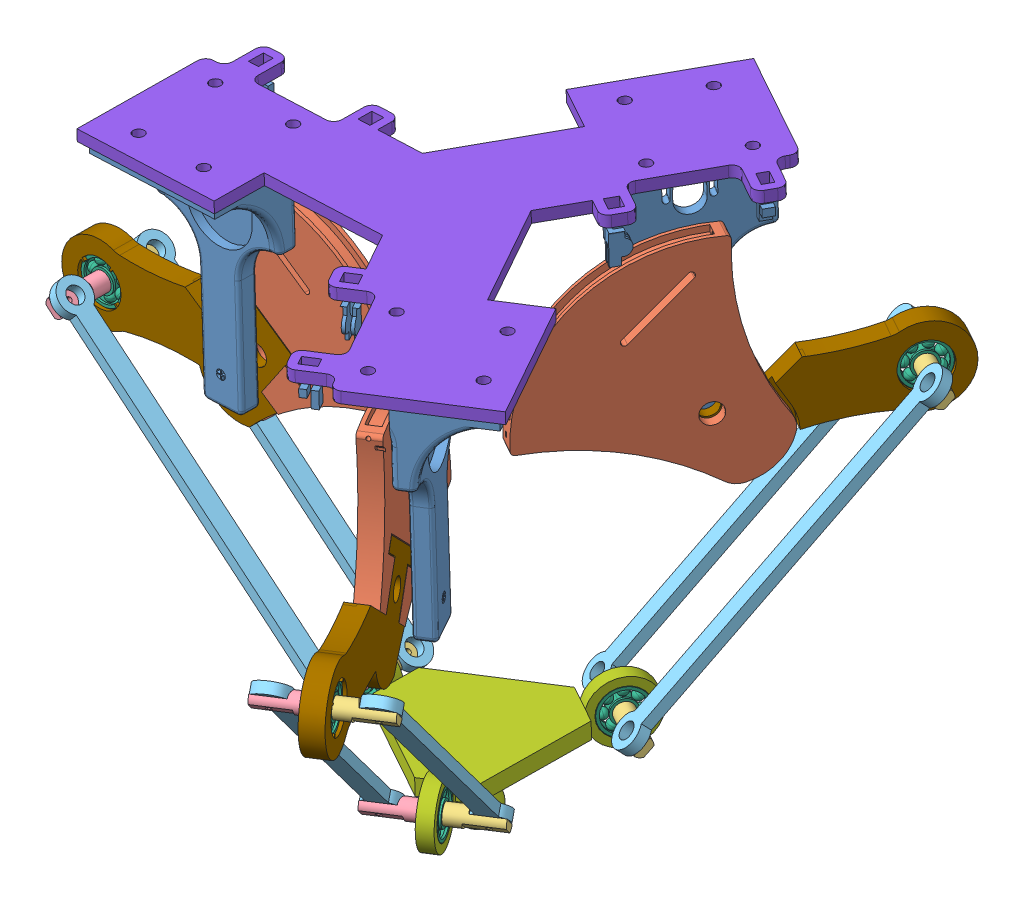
SolidWorks assembly 3D-Hapkit.SLDASM, configuration Default (file format 15000). Lengths in mm.
Overall size (316.55 274.88 353.95).
41 component instances, 9 part files, 75 mates.
Components (placement in the parent):
- Hapkit3_0_Base-3: Hapkit3_0_Base.SLDPRT [Default] at (129.5334 197.045 107.4607) x (0.500163 0.01316 -0.865831) z (-0.864834 -0.042739 -0.500236) size (72.8 114.98 77.62)
- Hapkit Sector Pulley-3: Hapkit Sector Pulley.SLDPRT [Default] at (135.7794 96.3952 109.3196) x (0.335527 0.691988 -0.639198) z (-0.864834 -0.042739 -0.500236) size (113.37 109.9 10.02)
- Hapkit3_0_Base-4: Hapkit3_0_Base.SLDPRT [Default] at (-15.1438 191.5074 184.9091) x (-0.999049 -0.043593 -0.000301) z (-0.000737 0.009973 0.99995) size (72.8 114.98 77.62)
- Hapkit Sector Pulley-4: Hapkit Sector Pulley.SLDPRT [Default] at (-10.9367 90.7398 183.8871) x (-0.828191 0.560411 -0.006199) z (-0.000737 0.009973 0.99995) size (113.37 109.9 10.02)
- Hapkit3_0_Base-5: Hapkit3_0_Base.SLDPRT [Default] at (124.152 198.4521 271.5627) x (0.498887 0.030433 0.866133) z (0.865571 0.032767 -0.499714) size (72.8 114.98 77.62)
- Hapkit Sector Pulley-5: Hapkit Sector Pulley.SLDPRT [Default] at (126.8851 97.6523 273.7496) x (0.353583 0.666654 0.656165) z (0.865571 0.032767 -0.499714) size (113.37 109.9 10.02)
- Copy of Copy of Assem18^3D-Hapkit-1: Copy of Copy of Assem18^3D-Hapkit.SLDASM [Default] at (314.4506 344.5997 544.5784) x (0.615917 -0.378367 -0.691003) z (-0.664342 -0.720883 -0.197425) size (52.68 10.1 36.25) (virtual)
  - Connector_Male-1: Connector_Male.SLDPRT [Default] at (147.9383 -61.4761 309.4484) x (0.495711 -0.130698 0.858597) z (0.065349 0.991422 0.113188) size (9 31 9)
  - Connector_Female-1: Connector_Female.SLDPRT [Default] at (141.8761 -61.4761 312.9484) x (-0.495711 0.130698 -0.858597) z (0.065349 0.991422 0.113188) size (9 31 9)
- Linkage-5: Linkage.SLDPRT [Default] at (161.8939 43.234 274.3194) x (0.291399 0.729119 0.619251) z (0.87577 0.057101 -0.47934) size (185.62 5 15.62)
- Linkage-6: Linkage.SLDPRT [Default] at (126.5759 41.897 294.7093) x (0.291399 0.729119 0.619251) z (0.87577 0.057101 -0.47934) size (185.62 5 15.62)
- Copy of Copy of Assem18^3D-Hapkit-2: Copy of Copy of Assem18^3D-Hapkit.SLDASM [Default] at (264.9128 220.6494 439.3057) x (0.615917 -0.378367 -0.691003) z (-0.664342 -0.720883 -0.197425) size (52.68 10.1 36.25) (virtual)
  - Connector_Male-1: Connector_Male.SLDPRT [Default] at (147.9383 -61.4761 309.4484) x (0.495711 -0.130698 0.858597) z (0.065349 0.991422 0.113188) size (9 31 9)
  - Connector_Female-1: Connector_Female.SLDPRT [Default] at (141.8761 -61.4761 312.9484) x (-0.495711 0.130698 -0.858597) z (0.065349 0.991422 0.113188) size (9 31 9)
- 608-2RS.step-1: 608-2RS.step.SLDPRT [Default] at (170.9281 101.1307 340.2602) x (-0.492662 -0.123309 -0.86144) z (-0.865571 -0.032767 0.499714) size (22 22 7)
- 608-2RS.step-2: 608-2RS.step.SLDPRT [Default] at (171.0133 102.2705 37.9082) x (-0.207141 -0.877238 0.433065) z (0.864834 0.042739 0.500236) size (22 22 7)
- 608-2RS.step-3: 608-2RS.step.SLDPRT [Default] at (-89.8674 83.0579 188.9058) x (-0.992355 -0.123414 0.0005) z (-0.000737 0.009973 0.99995) size (22 22 7)
- Copy (2) of Copy of Assem18^3D-Hapkit-1: Copy (2) of Copy of Assem18^3D-Hapkit.SLDASM [Default] at (156.7935 -142.3859 165.0484) x (-0.419801 0.261959 -0.868991) z (-0.72859 0.473672 0.494764) size (52.68 10.1 36.25) (virtual)
  - Connector_Male-1: Connector_Male.SLDPRT [Default] at (144.9048 -55.8729 296.5548) x (0.495711 -0.130698 0.858597) z (0.065349 0.991422 0.113188) size (9 31 9)
  - Connector_Female-1: Connector_Female.SLDPRT [Default] at (138.8426 -55.8729 300.0548) x (-0.495711 0.130698 -0.858597) z (0.065349 0.991422 0.113188) size (9 31 9)
- Linkage-7: Linkage.SLDPRT [Default] at (-21.7761 31.7146 167.9196) x (-0.762869 0.646521 0.00647) z (0.009547 0.001258 0.999954) size (185.62 5 15.62)
- Linkage-8: Linkage.SLDPRT [Default] at (-21.8062 32.1215 208.7207) x (-0.762869 0.646521 0.00647) z (0.009547 0.001258 0.999954) size (185.62 5 15.62)
- Copy (2) of Copy of Assem18^3D-Hapkit-2: Copy (2) of Copy of Assem18^3D-Hapkit.SLDASM [Default] at (286.4812 -252.2945 163.9485) x (-0.419801 0.261959 -0.868991) z (-0.72859 0.473672 0.494764) size (52.68 10.1 36.25) (virtual)
  - Connector_Male-1: Connector_Male.SLDPRT [Default] at (144.9048 -55.8729 296.5548) x (0.495711 -0.130698 0.858597) z (0.065349 0.991422 0.113188) size (9 31 9)
  - Connector_Female-1: Connector_Female.SLDPRT [Default] at (138.8426 -55.8729 300.0548) x (-0.495711 0.130698 -0.858597) z (0.065349 0.991422 0.113188) size (9 31 9)
- Copy (3) of Copy of Assem18^3D-Hapkit-1: Copy (3) of Copy of Assem18^3D-Hapkit.SLDASM [Default] at (104.658 -152.7454 226.9623) x (0.927399 0.36127 0.097032) z (-0.123365 0.540259 -0.832407) size (52.68 10.1 36.25) (virtual)
  - Connector_Male-1: Connector_Male.SLDPRT [Default] at (138.354 -67.231 285.2086) x (0.495711 -0.130698 0.858597) z (0.065349 0.991422 0.113188) size (9 31 9)
  - Connector_Female-1: Connector_Female.SLDPRT [Default] at (132.2918 -67.231 288.7086) x (-0.495711 0.130698 -0.858597) z (0.065349 0.991422 0.113188) size (9 31 9)
- Linkage-9: Linkage.SLDPRT [Default] at (161.8967 43.4707 102.6405) x (0.291492 0.741357 -0.604502) z (-0.870411 -0.056551 -0.489067) size (185.62 5 15.62)
- Linkage-10: Linkage.SLDPRT [Default] at (126.6088 41.7268 82.2293) x (0.291492 0.741357 -0.604502) z (-0.870411 -0.056551 -0.489067) size (185.62 5 15.62)
- Copy (3) of Copy of Assem18^3D-Hapkit-2: Copy (3) of Copy of Assem18^3D-Hapkit.SLDASM [Default] at (55.1045 -278.776 329.7276) x (0.927399 0.36127 0.097032) z (-0.123365 0.540259 -0.832407) size (52.68 10.1 36.25) (virtual)
  - Connector_Male-1: Connector_Male.SLDPRT [Default] at (138.354 -67.231 285.2086) x (0.495711 -0.130698 0.858597) z (0.065349 0.991422 0.113188) size (9 31 9)
  - Connector_Female-1: Connector_Female.SLDPRT [Default] at (132.2918 -67.231 288.7086) x (-0.495711 0.130698 -0.858597) z (0.065349 0.991422 0.113188) size (9 31 9)
- handle-1: handle.SLDPRT [Default] at (94.3981 -28.4797 187.8624) x (0.864834 0.042739 0.500236) z (-0.500163 -0.01316 0.865831) size (123.8 55.01 107.21)
- 608-2RS.step-4: 608-2RS.step.SLDPRT [Default] at (121.4597 -23.7602 140.6735) x (0.446619 0.389636 -0.805428) z (-0.864834 -0.042739 -0.500236) size (22 22 7)
- 608-2RS.step-5: 608-2RS.step.SLDPRT [Default] at (121.3903 -22.8196 234.9875) x (-0.471719 0.388368 -0.791613) z (-0.865571 -0.032767 0.499714) size (22 22 7)
- 608-2RS.step-6: 608-2RS.step.SLDPRT [Default] at (39.8203 -26.8507 187.8059) x (-0.92221 0.386664 -0.004536) z (-0.000737 0.009973 0.99995) size (22 22 7)
- base-1: base.SLDPRT [Default] at (-41.2235 187.463 194.5535) x (0.999049 0.043593 0.000301) z (-0.000737 0.009973 0.99995) size (243.71 5.5 256.75)
- Actuating Arm-1: Actuating Arm.SLDPRT [Default] at (135.5699 97.1343 109.6186) x (0.335527 0.691988 -0.639198) z (-0.864834 -0.042739 -0.500236) size (101.08 87.42 10)
- Actuating Arm-2: Actuating Arm.SLDPRT [Default] at (-10.2895 91.2502 183.8825) x (-0.828191 0.560411 -0.006199) z (-0.000737 0.009973 0.99995) size (101.08 87.42 10)
- Actuating Arm-3: Actuating Arm.SLDPRT [Default] at (126.6949 98.4039 273.4695) x (0.353583 0.666654 0.656165) z (0.865571 0.032767 -0.499714) size (101.08 87.42 10)
Mates (geometry in assembly coordinates):
- Concentric28: concentric anti-aligned: cylinder of handle-1 through (107.6224 -24.444 132.6698) axis (0.864834 0.042739 0.500236) radius 11; cylinder of 608-2RS.step-4 through (121.4597 -23.7602 140.6735) axis (-0.864834 -0.042739 -0.500236) radius 4
- Coincident58: coincident aligned: plane of handle-1 through (118.4328 -23.9098 138.9227) normal (-0.864834 -0.042739 -0.500236); plane of 608-2RS.step-4 through (120.9555 -34.0295 135.426) normal (-0.864834 -0.042739 -0.500236)
- Concentric29: concentric aligned: cylinder of handle-1 through (135.2394 -22.2953 226.9921) axis (-0.865571 -0.032767 0.499714) radius 11; cylinder of 608-2RS.step-5 through (121.3903 -22.8196 234.9875) axis (-0.865571 -0.032767 0.499714) radius 4
- Coincident59: coincident aligned: plane of handle-1 through (118.3608 -22.9343 236.7365) normal (-0.865571 -0.032767 0.499714); plane of 608-2RS.step-5 through (116.5113 -33.0644 232.8687) normal (-0.865571 -0.032767 0.499714)
- Concentric30: concentric anti-aligned: cylinder of handle-1 through (39.8085 -26.6911 203.8051) axis (0.000737 -0.009973 -0.99995) radius 11; cylinder of 608-2RS.step-6 through (39.8203 -26.8507 187.8059) axis (-0.000737 0.009973 0.99995) radius 11
- Coincident60: coincident aligned: plane of handle-1 through (39.8228 -26.8856 184.3061) normal (0.000737 -0.009973 -0.99995); plane of 608-2RS.step-6 through (36.2266 -35.4618 184.389) normal (0.000737 -0.009973 -0.99995)
- Concentric5: concentric anti-aligned: cylinder of Hapkit3_0_Base-3 through (115.8191 95.4088 97.7742) axis (0.864834 0.042739 0.500236) radius 7.5; cylinder of Hapkit Sector Pulley-3 through (135.7794 96.3952 109.3196) axis (-0.864834 -0.042739 -0.500236) radius 5
- Distance4: distance = 8 mm anti-aligned: plane of Hapkit3_0_Base-3 through (104.8535 81.0797 128.1113) normal (0.864834 0.042739 0.500236); plane of Hapkit3_0_Sector-3 through (171.4675 107.9939 26.6387) normal (-0.864834 -0.042739 -0.500236)
- Concentric2: concentric anti-aligned: cylinder of Hapkit Sector Pulley-3 through (135.7794 96.3952 109.3196) axis (-0.864834 -0.042739 -0.500236) radius 5; cylinder of Hapkit3_0_Base-3 through (115.8191 95.4088 97.7742) axis (0.864834 0.042739 0.500236) radius 7.5
- Concentric34: concentric anti-aligned: cylinder of Hapkit3_0_Base-4 through (-10.9538 90.9699 206.9659) axis (0.000737 -0.009973 -0.99995) radius 7.5; cylinder of Hapkit Sector Pulley-4 through (-10.9367 90.7398 183.8871) axis (-0.000737 0.009973 0.99995) radius 5
- Distance9: distance = 8 mm anti-aligned: plane of Hapkit3_0_Base-4 through (21.576 78.1858 202.0371) normal (0.000737 -0.009973 -0.99995); plane of Hapkit3_0_Sector-4 through (-101.13 87.5536 193.8529) normal (-0.000737 0.009973 0.99995)
- Concentric35: concentric anti-aligned: cylinder of Hapkit Sector Pulley-4 through (-10.9367 90.7398 183.8871) axis (-0.000737 0.009973 0.99995) radius 5; cylinder of Hapkit3_0_Base-4 through (-10.9538 90.9699 206.9659) axis (0.000737 -0.009973 -0.99995) radius 7.5
- Concentric37: concentric anti-aligned: cylinder of Hapkit3_0_Base-5 through (146.8625 98.4085 262.2162) axis (-0.865571 -0.032767 0.499714) radius 7.5; cylinder of Hapkit Sector Pulley-5 through (126.8851 97.6523 273.7496) axis (0.865571 0.032767 -0.499714) radius 5
- Distance11: distance = 8 mm anti-aligned: plane of Hapkit3_0_Base-5 through (127.1473 83.1442 237.2318) normal (-0.865571 -0.032767 0.499714); plane of Hapkit3_0_Sector-5 through (180.1891 106.8819 346.6729) normal (0.865571 0.032767 -0.499714)
- Concentric20: concentric aligned: cylinder of Copy of Copy of Assem18^3D-Hapkit-1/Connector_Male-1 through (190.3189 98.7302 332.8638) axis (-0.384856 0.682 -0.621902) radius 1.35; cylinder of Linkage-5 through (188.587 101.7992 330.0652) axis (-0.384856 0.682 -0.621902) radius 3.9
- Coincident50: coincident anti-aligned: plane of Copy of Copy of Assem18^3D-Hapkit-1/Connector_Male-1 through (189.2486 105.0574 333.229) normal (-0.384856 0.682 -0.621902); plane of Linkage-5 through (188.587 101.7992 330.0652) normal (0.384856 -0.682 0.621902)
- Concentric22: concentric aligned: cylinder of Copy of Copy of Assem18^3D-Hapkit-1/Connector_Female-1 through (155.0009 97.3932 353.2537) axis (-0.384856 0.682 -0.621902) radius 1.35; cylinder of Linkage-6 through (153.2691 100.4622 350.4551) axis (-0.384856 0.682 -0.621902) radius 3.9
- Coincident52: coincident anti-aligned: plane of Copy of Copy of Assem18^3D-Hapkit-1/Connector_Female-1 through (152.6075 97.2039 347.2914) normal (-0.384856 0.682 -0.621902); plane of Linkage-6 through (153.2691 100.4622 350.4551) normal (0.384856 -0.682 0.621902)
- Coincident54: coincident anti-aligned: plane of Linkage-5 through (188.587 101.7992 330.0652) normal (0.384856 -0.682 0.621902); plane of Copy of Copy of Assem18^3D-Hapkit-2/Connector_Male-1 through (139.7108 -18.8929 227.9563) normal (-0.384856 0.682 -0.621902)
- Concentric24: concentric anti-aligned: circle of Green Linkage-5; circle of Copy of Copy of Assem18^3D-Hapkit-2/Pink Linkage_Famale-1
- Coincident53: coincident anti-aligned: plane of Linkage-6 through (153.2691 100.4622 350.4551) normal (0.384856 -0.682 0.621902); plane of Copy of Copy of Assem18^3D-Hapkit-2/Connector_Female-1 through (103.0697 -26.7463 242.0188) normal (-0.384856 0.682 -0.621902)
- Concentric23: concentric aligned: cylinder of Linkage-6 through (103.7313 -23.4881 245.1825) axis (-0.384856 0.682 -0.621902) radius 3.9; cylinder of Copy of Copy of Assem18^3D-Hapkit-2/Connector_Female-1 through (105.4631 -26.5571 247.981) axis (-0.384856 0.682 -0.621902) radius 1.35
- Concentric41: concentric anti-aligned: cylinder of Copy of Copy of Assem18^3D-Hapkit-1/Connector_Female-1 through (167.8986 101.016 342.0092) axis (0.865571 0.032767 -0.499714) radius 3.95; cylinder of 608-2RS.step-1 through (170.9281 101.1307 340.2602) axis (-0.865571 -0.032767 0.499714) radius 4
- Coincident75: coincident anti-aligned: plane of Copy of Copy of Assem18^3D-Hapkit-1/Connector_Female-1 through (167.8986 101.016 342.0092) normal (0.865571 0.032767 -0.499714); plane of 608-2RS.step-1 through (168.4107 95.3626 342.5256) normal (-0.865571 -0.032767 0.499714)
- Concentric42: concentric anti-aligned: cylinder of Copy of Copy of Assem18^3D-Hapkit-2/Connector_Female-1 through (118.3608 -22.9343 236.7365) axis (0.865571 0.032767 -0.499714) radius 3.95; cylinder of 608-2RS.step-5 through (121.3903 -22.8196 234.9875) axis (-0.865571 -0.032767 0.499714) radius 4
- Coincident76: coincident anti-aligned: plane of Copy of Copy of Assem18^3D-Hapkit-2/Connector_Male-1 through (124.4197 -22.7049 233.2385) normal (-0.865571 -0.032767 0.499714); plane of 608-2RS.step-5 through (123.7472 -26.3886 231.832) normal (0.865571 0.032767 -0.499714)
- Concentric43: concentric aligned: cylinder of Copy (2) of Copy of Assem18^3D-Hapkit-1/Connector_Male-1 through (-92.7616 79.4214 168.5373) axis (0.646483 0.762895 -0.007132) radius 1.35; cylinder of Linkage-7 through (-89.8524 82.8544 168.5052) axis (0.646483 0.762895 -0.007132) radius 3.9
- Coincident77: coincident anti-aligned: plane of Copy (2) of Copy of Assem18^3D-Hapkit-1/Connector_Male-1 through (-86.4199 79.9544 169.4383) normal (0.646483 0.762895 -0.007132); plane of Linkage-7 through (-89.8524 82.8544 168.5052) normal (-0.646483 -0.762895 0.007132)
- Concentric44: concentric aligned: cylinder of Copy (2) of Copy of Assem18^3D-Hapkit-1/Connector_Female-1 through (-92.7916 79.8283 209.3384) axis (0.646483 0.762895 -0.007132) radius 1.35; cylinder of Linkage-8 through (-89.8824 83.2613 209.3063) axis (0.646483 0.762895 -0.007132) radius 3.9
- Coincident78: coincident anti-aligned: plane of Copy (2) of Copy of Assem18^3D-Hapkit-1/Connector_Female-1 through (-93.315 86.1613 208.3733) normal (0.646483 0.762895 -0.007132); plane of Linkage-8 through (-89.8824 83.2613 209.3063) normal (-0.646483 -0.762895 0.007132)
- Coincident79: coincident anti-aligned: plane of Linkage-7 through (-89.8524 82.8544 168.5052) normal (-0.646483 -0.762895 0.007132); plane of Copy (2) of Copy of Assem18^3D-Hapkit-2/Connector_Male-1 through (43.2678 -29.9542 168.3384) normal (0.646483 0.762895 -0.007132)
- Concentric45: concentric anti-aligned: circle of Green Linkage-7; circle of Copy (2) of Copy of Assem18^3D-Hapkit-2/Pink Linkage_Famale-1
- Coincident80: coincident anti-aligned: plane of Linkage-8 through (-89.8824 83.2613 209.3063) normal (-0.646483 -0.762895 0.007132); plane of Copy (2) of Copy of Assem18^3D-Hapkit-2/Connector_Female-1 through (36.3727 -23.7472 207.2734) normal (0.646483 0.762895 -0.007132)
- Concentric46: concentric aligned: cylinder of Linkage-8 through (39.8052 -26.6472 208.2064) axis (0.646483 0.762895 -0.007132) radius 3.9; cylinder of Copy (2) of Copy of Assem18^3D-Hapkit-2/Connector_Female-1 through (36.8961 -30.0803 208.2385) axis (0.646483 0.762895 -0.007132) radius 1.35
- Concentric47: concentric anti-aligned: cylinder of 608-2RS.step-3 through (-89.8674 83.0579 188.9058) axis (-0.000737 0.009973 0.99995) radius 4; cylinder of Copy (2) of Copy of Assem18^3D-Hapkit-1/Connector_Female-1 through (-89.87 83.0928 192.4056) axis (0.000737 -0.009973 -0.99995) radius 3.95
- Coincident81: coincident anti-aligned: plane of 608-2RS.step-3 through (-89.3712 79.0537 185.4459) normal (0.000737 -0.009973 -0.99995); plane of Copy (2) of Copy of Assem18^3D-Hapkit-1/Connector_Male-1 through (-89.8648 83.023 185.406) normal (-0.000737 0.009973 0.99995)
- Concentric48: concentric anti-aligned: cylinder of Copy (2) of Copy of Assem18^3D-Hapkit-2/Connector_Female-1 through (39.8177 -26.8158 191.3057) axis (0.000737 -0.009973 -0.99995) radius 3.95; cylinder of 608-2RS.step-6 through (39.8203 -26.8507 187.8059) axis (-0.000737 0.009973 0.99995) radius 4
- Concentric49: concentric aligned: cylinder of Copy (3) of Copy of Assem18^3D-Hapkit-1/Connector_Male-1 through (190.4427 100.1332 45.2842) axis (-0.396758 0.668724 0.628801) radius 1.35; cylinder of Linkage-9 through (188.6573 103.1424 48.1138) axis (-0.396758 0.668724 0.628801) radius 3.9
- Coincident82: coincident anti-aligned: plane of Copy (3) of Copy of Assem18^3D-Hapkit-1/Connector_Male-1 through (186.4932 99.7636 50.3416) normal (-0.396758 0.668724 0.628801); plane of Linkage-9 through (188.6573 103.1424 48.1138) normal (0.396758 -0.668724 -0.628801)
- Concentric50: concentric aligned: cylinder of Copy (3) of Copy of Assem18^3D-Hapkit-1/Connector_Female-1 through (155.1548 98.3893 24.873) axis (-0.396758 0.668724 0.628801) radius 1.35; cylinder of Linkage-10 through (153.3694 101.3985 27.7026) axis (-0.396758 0.668724 0.628801) radius 3.9
- Coincident83: coincident anti-aligned: plane of Copy (3) of Copy of Assem18^3D-Hapkit-1/Connector_Female-1 through (155.5335 104.7773 25.4748) normal (-0.396758 0.668724 0.628801); plane of Linkage-10 through (153.3694 101.3985 27.7026) normal (0.396758 -0.668724 -0.628801)
- Coincident84: coincident anti-aligned: plane of Linkage-9 through (188.6573 103.1424 48.1138) normal (0.396758 -0.668724 -0.628801); plane of Copy (3) of Copy of Assem18^3D-Hapkit-2/Connector_Male-1 through (136.9396 -26.2671 153.1069) normal (-0.396758 0.668724 0.628801)
- Concentric51: concentric anti-aligned: circle of Green Linkage-9; circle of Copy (3) of Copy of Assem18^3D-Hapkit-2/Pink Linkage_Famale-1
- Coincident85: coincident anti-aligned: plane of Linkage-10 through (153.3694 101.3985 27.7026) normal (0.396758 -0.668724 -0.628801); plane of Copy (3) of Copy of Assem18^3D-Hapkit-2/Connector_Female-1 through (105.9799 -21.2534 128.2401) normal (-0.396758 0.668724 0.628801)
- Concentric52: concentric aligned: cylinder of Linkage-10 through (103.8158 -24.6322 130.4679) axis (-0.396758 0.668724 0.628801) radius 3.9; cylinder of Copy (3) of Copy of Assem18^3D-Hapkit-2/Connector_Female-1 through (105.6012 -27.6414 127.6383) axis (-0.396758 0.668724 0.628801) radius 1.35
- Concentric53: concentric aligned: cylinder of 608-2RS.step-2 through (171.0133 102.2705 37.9082) axis (0.864834 0.042739 0.500236) radius 4; cylinder of Copy (3) of Copy of Assem18^3D-Hapkit-1/Connector_Female-1 through (167.9864 102.1209 36.1574) axis (0.864834 0.042739 0.500236) radius 3.95
- Coincident86: coincident anti-aligned: plane of 608-2RS.step-2 through (176.647 99.6946 35.3851) normal (0.864834 0.042739 0.500236); plane of Copy (3) of Copy of Assem18^3D-Hapkit-1/Connector_Male-1 through (174.0402 102.4201 39.659) normal (-0.864834 -0.042739 -0.500236)
- Concentric54: concentric anti-aligned: cylinder of Copy (3) of Copy of Assem18^3D-Hapkit-2/Connector_Female-1 through (118.4328 -23.9098 138.9227) axis (0.864834 0.042739 0.500236) radius 3.95; cylinder of 608-2RS.step-4 through (121.4597 -23.7602 140.6735) axis (-0.864834 -0.042739 -0.500236) radius 4
- Coincident87: coincident anti-aligned: plane of Copy (3) of Copy of Assem18^3D-Hapkit-2/Connector_Male-1 through (124.4867 -23.6106 142.4244) normal (-0.864834 -0.042739 -0.500236); plane of handle-1 through (124.4867 -23.6106 142.4244) normal (0.864834 0.042739 0.500236)
- Concentric55: concentric anti-aligned: cylinder of Copy (2) of Copy of Assem18^3D-Hapkit-2/Connector_Female-1 through (39.8177 -26.8158 191.3057) axis (0.000737 -0.009973 -0.99995) radius 3.95; cylinder of 608-2RS.step-6 through (39.8203 -26.8507 187.8059) axis (-0.000737 0.009973 0.99995) radius 4
- Coincident88: coincident anti-aligned: plane of Copy (2) of Copy of Assem18^3D-Hapkit-2/Connector_Male-1 through (39.8228 -26.8856 184.3061) normal (-0.000737 0.009973 0.99995); plane of 608-2RS.step-6 through (38.2761 -30.5743 184.3417) normal (0.000737 -0.009973 -0.99995)
- Concentric59: concentric aligned: circle of Hapkit3_0_Base-5; circle of base-1
- Coincident115: coincident anti-aligned: plane of Hapkit3_0_Base-5 through (141.4634 199.1075 261.5684) normal (-0.043588 0.999 -0.009995); plane of base-1 through (145.5662 199.5657 289.4712) normal (0.043588 -0.999 0.009995)
- Concentric60: concentric aligned: circle of Hapkit3_0_Base-5; circle of base-1
- Coincident117: coincident anti-aligned: plane of Hapkit3_0_Base-4 through (-15.1586 191.7069 204.9081) normal (-0.043588 0.999 -0.009995); plane of base-1 through (145.5662 199.5657 289.4712) normal (0.043588 -0.999 0.009995)
- Concentric61: concentric aligned: cylinder of Hapkit3_0_Base-4 through (1.0913 197.612 232.0125) axis (0.043588 -0.999 0.009995) radius 2.5; cylinder of base-1 through (0.8698 202.6869 231.9618) axis (0.043588 -0.999 0.009995) radius 2.75
- Concentric62: concentric aligned: cylinder of Hapkit3_0_Base-4 through (-31.8774 196.1734 232.0026) axis (0.043588 -0.999 0.009995) radius 2.5; cylinder of base-1 through (-32.0988 201.2483 231.9518) axis (0.043588 -0.999 0.009995) radius 2.75
- Coincident118: coincident anti-aligned: plane of Hapkit3_0_Base-3 through (112.2367 196.1903 97.456) normal (-0.043588 0.999 -0.009995); plane of base-1 through (145.5662 199.5657 289.4712) normal (0.043588 -0.999 0.009995)
- Concentric63: concentric aligned: circle of Hapkit3_0_Base-3; circle of base-1
- Concentric64: concentric anti-aligned: circle of Hapkit3_0_Base-3; circle of base-1
- Coincident121: coincident anti-aligned: plane of Hapkit Sector Pulley-4 through (101.9547 -54.0897 190.4149) normal (-0.000737 0.009973 0.99995); plane of Actuating Arm-2 through (-85.0601 263.2478 187.1123) normal (0.000737 -0.009973 -0.99995)
- Coincident124: coincident anti-aligned: plane of Hapkit Sector Pulley-4 through (1.0148 70.5532 189.0975) normal (-0.560445 -0.828154 0.007846); plane of Actuating Arm-2 through (1.0184 70.5034 184.0977) normal (0.560445 0.828154 -0.007846)
- Coincident125: coincident anti-aligned: plane of Hapkit Sector Pulley-4 through (-7.6401 76.4097 189.0327) normal (-0.828191 0.560411 -0.006199); plane of Actuating Arm-2 through (4.3434 94.1727 193.8646) normal (0.828191 -0.560411 0.006199)
- Concentric65: concentric aligned: cylinder of 608-2RS.step-3 through (-89.8674 83.0579 188.9058) axis (-0.000737 0.009973 0.99995) radius 11; cylinder of Actuating Arm-2 through (-89.8637 83.008 183.906) axis (-0.000737 0.009973 0.99995) radius 11
- Coincident126: coincident anti-aligned: plane of Hapkit Sector Pulley-3 through (94.0233 -65.586 185.3538) normal (-0.864834 -0.042739 -0.500236); plane of Actuating Arm-1 through (146.8193 278.8901 64.646) normal (0.864834 0.042739 0.500236)
- Coincident127: coincident anti-aligned: plane of Hapkit Sector Pulley-3 through (138.8338 96.4002 94.0433) normal (0.373476 -0.720642 -0.584115); plane of Actuating Arm-1 through (132.5768 74.7913 116.7022) normal (-0.373476 0.720642 0.584115)
- Coincident128: coincident anti-aligned: plane of Hapkit Sector Pulley-3 through (131.0457 111.4279 106.2239) normal (-0.335527 -0.691988 0.639198); plane of Actuating Arm-1 through (126.5215 111.6001 104.0355) normal (0.335527 0.691988 -0.639198)
- Concentric66: concentric anti-aligned: cylinder of 608-2RS.step-2 through (171.0133 102.2705 37.9082) axis (0.864834 0.042739 0.500236) radius 11; cylinder of Actuating Arm-1 through (175.3375 102.4842 40.4094) axis (-0.864834 -0.042739 -0.500236) radius 11
- Coincident132: coincident anti-aligned: plane of 608-2RS.step-3 through (-88.5125 72.1774 192.5155) normal (-0.000737 0.009973 0.99995); plane of Actuating Arm-2 through (-10.2957 91.335 192.382) normal (0.000737 -0.009973 -0.99995)
- Coincident134: coincident anti-aligned: plane of 608-2RS.step-2 through (172.2396 97.6741 29.1841) normal (-0.864834 -0.042739 -0.500236); plane of Actuating Arm-1 through (128.2188 96.771 105.3666) normal (0.864834 0.042739 0.500236)
- Coincident136: coincident anti-aligned: plane of Hapkit Sector Pulley-5 through (89.558 -60.887 188.693) normal (0.865571 0.032767 -0.499714); plane of Actuating Arm-3 through (151.348 278.9396 318.004) normal (-0.865571 -0.032767 0.499714)
- Coincident137: coincident anti-aligned: plane of Hapkit Sector Pulley-5 through (138.5969 97.5199 284.0216) normal (0.354637 -0.744647 0.56545); plane of Actuating Arm-3 through (142.9247 97.6837 281.523) normal (-0.354637 0.744647 -0.56545)
- Coincident138: coincident anti-aligned: plane of Hapkit Sector Pulley-5 through (131.2016 113.0482 272.2301) normal (-0.353583 -0.666654 -0.656165); plane of Actuating Arm-3 through (135.3395 113.6108 269.4288) normal (0.353583 0.666654 0.656165)
- Concentric68: concentric anti-aligned: cylinder of 608-2RS.step-1 through (170.9281 101.1307 340.2602) axis (-0.865571 -0.032767 0.499714) radius 11; cylinder of Actuating Arm-3 through (166.6002 100.9668 342.7588) axis (0.865571 0.032767 -0.499714) radius 11
- Coincident139: coincident anti-aligned: plane of 608-2RS.step-1 through (174.7931 92.0214 339.3537) normal (0.865571 0.032767 -0.499714); plane of Actuating Arm-3 through (134.0523 98.6824 269.2219) normal (-0.865571 -0.032767 0.499714)
